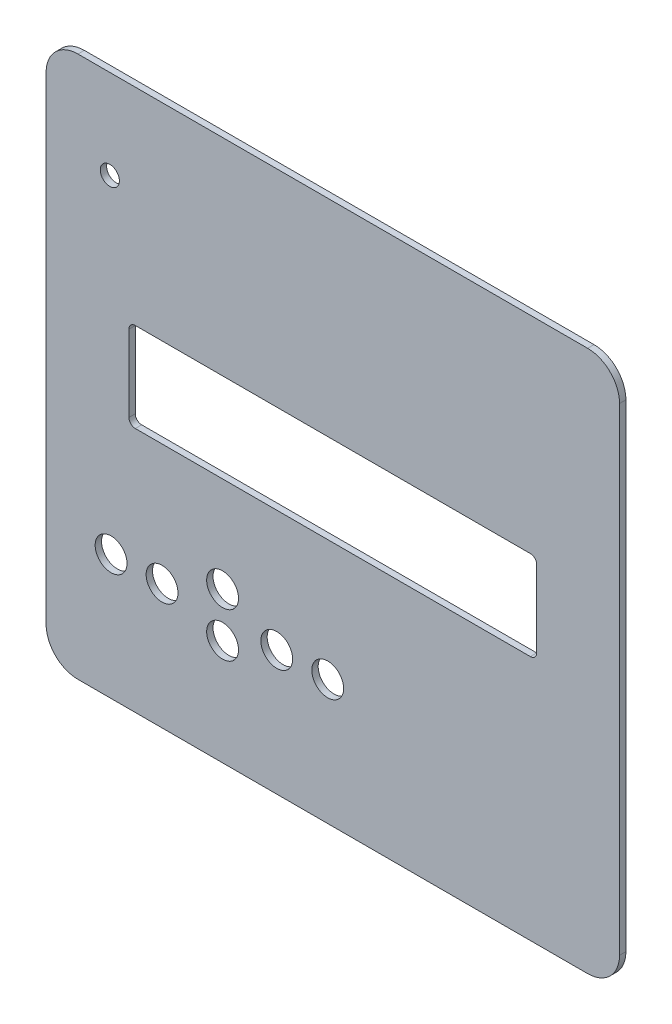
from build123d import *

# Parameters (mm, degrees)
EXTRUDE_1_DEPTH     = 1
SKETCH_2_R          = 1.5
SKETCH_2_R_2        = 2.5
CUT_EXTRUDE_1_DEPTH = 62.905169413


with BuildPart() as part:
    # Sketch 1 → Extrude 1 (new body)
    with BuildSketch(Plane.XY):
        with BuildLine():
            Line((-40, 42.5), (40, 42.5))
            ThreePointArc((40, 42.5), (43.535533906, 41.035533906), (45, 37.5))
            Line((45, 37.5), (45, -37.5))
            ThreePointArc((45, -37.5), (43.535533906, -41.035533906), (40, -42.5))
            Line((40, -42.5), (-40, -42.5))
            ThreePointArc((-40, -42.5), (-43.535533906, -41.035533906), (-45, -37.5))
            Line((-45, -37.5), (-45, 37.5))
            ThreePointArc((-45, 37.5), (-43.535533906, 41.035533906), (-40, 42.5))
        make_face()
    extrude(amount=EXTRUDE_1_DEPTH)

    # Sketch 2 → Cut-Extrude 1 (cut, through all)
    with BuildSketch(Plane.XY.offset(1)):
        with Locations((-35, 28.5)):
            Circle(SKETCH_2_R)
        with Locations((-34.8, -22.9)):
            Circle(SKETCH_2_R_2)
        with Locations((-26.8, -22.9)):
            Circle(SKETCH_2_R_2)
        with Locations((-17.3, -18.9)):
            Circle(SKETCH_2_R_2)
        with Locations((-17.3, -25.9)):
            Circle(SKETCH_2_R_2)
        with Locations((-8.8, -22.9)):
            Circle(SKETCH_2_R_2)
        with Locations((-0.8, -22.9)):
            Circle(SKETCH_2_R_2)
        with BuildLine():
            Line((-31, 10.1), (31, 10.1))
            ThreePointArc((31, 10.1), (31.707106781, 9.807106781), (32, 9.1))
            Line((32, 9.1), (32, -2.9))
            ThreePointArc((32, -2.9), (31.707106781, -3.607106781), (31, -3.9))
            Line((31, -3.9), (-31, -3.9))
            ThreePointArc((-31, -3.9), (-31.707106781, -3.607106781), (-32, -2.9))
            Line((-32, -2.9), (-32, 9.1))
            ThreePointArc((-32, 9.1), (-31.707106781, 9.807106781), (-31, 10.1))
        make_face()
    extrude(amount=-CUT_EXTRUDE_1_DEPTH, mode=Mode.SUBTRACT)


solid = part.part
